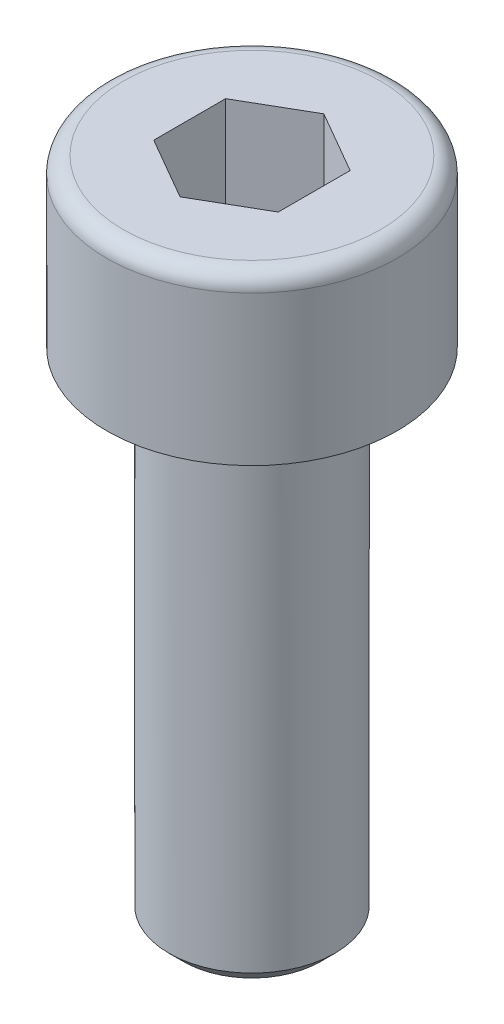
from build123d import *

# Parameters (mm, degrees)
CHANFREIN1_SIZE = 0.35
EMPREINTE_DEPTH = 2.88


with BuildPart() as part:
    # E_corps → corps (revolve)
    with BuildSketch(Plane.XY, mode=Mode.PRIVATE) as corps_sk:
        with BuildLine():
            Line((2, -4), (3.5, -4))
            Line((3.5, -4), (3.5, -0.4))
            ThreePointArc((3.5, -0.4), (3.382842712, -0.117157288), (3.1, 0))
            Line((3.1, 0), (0, 0))
            Line((0, 0), (0, -16))
            Line((0, -16), (2, -16))
            Line((2, -16), (2, -4))
        make_face()
    revolve(corps_sk.sketch.rotate(Axis((0, 65.117292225, 0), (0, -1, 0)), 180), axis=Axis((0, 65.117292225, 0), (0, -1, 0)))

    # Chanfrein1
    chanfrein1_edges = [part.edges().sort_by_distance(p)[0] for p in [
        (2, -16, 0),
    ]]
    chamfer(chanfrein1_edges, length=CHANFREIN1_SIZE)

    # E_empreinte → Empreinte (cut)
    with BuildSketch(Plane(origin=(0, 0, 0), x_dir=(-1, 0, 0), z_dir=(0, 1, 0))):
        Polygon((0, -1.732050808), (-1.5, -0.866025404), (-1.5, 0.866025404), (0, 1.732050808), (1.5, 0.866025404), (1.5, -0.866025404), align=None)
    extrude(amount=-EMPREINTE_DEPTH, mode=Mode.SUBTRACT)

    # Esquisse2 → Enlever de la mati_re-lisser1 section 0
    with BuildSketch(Plane(origin=(0, -2.88, 0), x_dir=(-1, 0, 0), z_dir=(0, 1, 0)), mode=Mode.PRIVATE) as enlever_de_la_mati_re_lisser1_s0:
        with BuildLine():
            Line((0, -1.732050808), (1.5, -0.866025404))
            Line((1.5, -0.866025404), (1.5, 0.866025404))
            Line((1.5, 0.866025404), (0, 1.732050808))
            Line((0, 1.732050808), (-1.5, 0.866025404))
            Line((-1.5, 0.866025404), (-1.5, -0.866025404))
            Line((-1.5, -0.866025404), (0, -1.732050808))
        make_face()
    loft([Vertex(0, -3.2, 0), enlever_de_la_mati_re_lisser1_s0.sketch], mode=Mode.SUBTRACT)


solid = part.part
